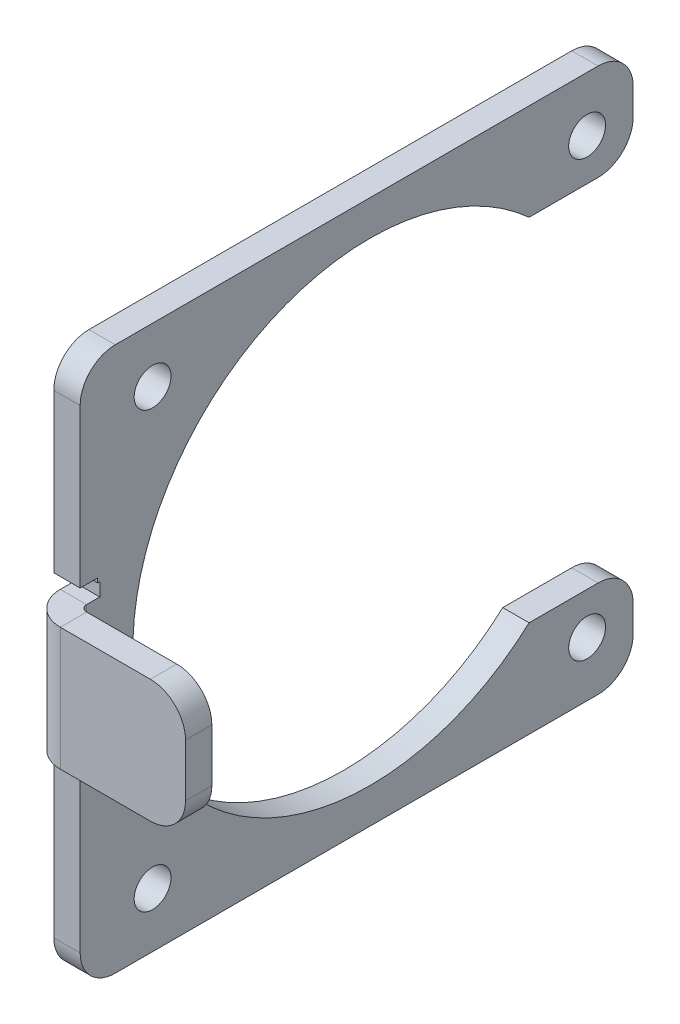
ISO-10303-21;
HEADER;
FILE_DESCRIPTION(('STEP AP214'),'2;1');
FILE_NAME('part.step','',(''),(''),'','','');
FILE_SCHEMA(('AUTOMOTIVE_DESIGN { 1 0 10303 214 1 1 1 1 }'));
ENDSEC;
DATA;
#1=APPLICATION_CONTEXT('core data for automotive mechanical design processes');
#2=APPLICATION_PROTOCOL_DEFINITION('international standard','automotive_design',2000,#1);
#3=PRODUCT_CONTEXT('',#1,'mechanical');
#4=PRODUCT('Part','Part','',(#3));
#5=PRODUCT_RELATED_PRODUCT_CATEGORY('part','',(#4));
#6=PRODUCT_DEFINITION_FORMATION('','',#4);
#7=PRODUCT_DEFINITION_CONTEXT('part definition',#1,'design');
#8=PRODUCT_DEFINITION('design','',#6,#7);
#9=PRODUCT_DEFINITION_SHAPE('','',#8);
#10=(LENGTH_UNIT() NAMED_UNIT(*) SI_UNIT(.MILLI.,.METRE.));
#11=(NAMED_UNIT(*) PLANE_ANGLE_UNIT() SI_UNIT($,.RADIAN.));
#12=(NAMED_UNIT(*) SI_UNIT($,.STERADIAN.) SOLID_ANGLE_UNIT());
#13=UNCERTAINTY_MEASURE_WITH_UNIT(LENGTH_MEASURE(1.E-05),#10,'distance_accuracy_value','');
#14=(GEOMETRIC_REPRESENTATION_CONTEXT(3) GLOBAL_UNCERTAINTY_ASSIGNED_CONTEXT((#13)) GLOBAL_UNIT_ASSIGNED_CONTEXT((#10,
#11,#12)) REPRESENTATION_CONTEXT('',''));
#15=CARTESIAN_POINT('',(0.,0.,0.));
#16=DIRECTION('',(0.,0.,1.));
#17=DIRECTION('',(1.,0.,0.));
#18=AXIS2_PLACEMENT_3D('',#15,#16,#17);
#19=CARTESIAN_POINT('',(-3.,0.,0.));
#20=DIRECTION('',(-1.,0.,0.));
#21=DIRECTION('',(0.,0.,1.));
#22=AXIS2_PLACEMENT_3D('',#19,#20,#21);
#23=PLANE('',#22);
#24=CARTESIAN_POINT('',(-3.,55.7487373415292,-8.25126265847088));
#25=DIRECTION('',(1.,0.,0.));
#26=DIRECTION('',(0.,0.,-1.));
#27=AXIS2_PLACEMENT_3D('',#24,#25,#26);
#28=CIRCLE('',#27,2.1);
#29=CARTESIAN_POINT('',(-3.,55.7487373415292,-10.3512626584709));
#30=VERTEX_POINT('',#29);
#31=EDGE_CURVE('E605',#30,#30,#28,.T.);
#32=ORIENTED_EDGE('',*,*,#31,.T.);
#33=EDGE_LOOP('',(#32));
#34=FACE_BOUND('',#33,.T.);
#35=DIRECTION('',(0.,0.,1.));
#36=VECTOR('',#35,1.);
#37=CARTESIAN_POINT('',(-3.,11.,0.));
#38=LINE('',#37,#36);
#39=CARTESIAN_POINT('',(-3.,11.,-51.1383571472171));
#40=VERTEX_POINT('',#39);
#41=CARTESIAN_POINT('',(-3.,11.,-59.));
#42=VERTEX_POINT('',#41);
#43=EDGE_CURVE('E260',#40,#42,#38,.F.);
#44=ORIENTED_EDGE('',*,*,#43,.T.);
#45=CARTESIAN_POINT('',(-3.,7.,-59.));
#46=DIRECTION('',(-1.,0.,0.));
#47=DIRECTION('',(0.,0.,1.));
#48=AXIS2_PLACEMENT_3D('',#45,#46,#47);
#49=CIRCLE('',#48,4.);
#50=CARTESIAN_POINT('',(-3.,7.,-63.));
#51=VERTEX_POINT('',#50);
#52=EDGE_CURVE('E445',#42,#51,#49,.T.);
#53=ORIENTED_EDGE('',*,*,#52,.T.);
#54=DIRECTION('',(0.,1.,0.));
#55=VECTOR('',#54,1.);
#56=CARTESIAN_POINT('',(-3.,0.,-63.));
#57=LINE('',#56,#55);
#58=CARTESIAN_POINT('',(-3.,4.,-63.));
#59=VERTEX_POINT('',#58);
#60=EDGE_CURVE('E412',#59,#51,#57,.T.);
#61=ORIENTED_EDGE('',*,*,#60,.F.);
#62=CARTESIAN_POINT('',(-3.,4.,-59.));
#63=DIRECTION('',(-1.,0.,0.));
#64=DIRECTION('',(0.,0.,1.));
#65=AXIS2_PLACEMENT_3D('',#62,#63,#64);
#66=CIRCLE('',#65,4.);
#67=CARTESIAN_POINT('',(-3.,0.,-59.));
#68=VERTEX_POINT('',#67);
#69=EDGE_CURVE('E440',#59,#68,#66,.T.);
#70=ORIENTED_EDGE('',*,*,#69,.T.);
#71=DIRECTION('',(0.,0.,-1.));
#72=VECTOR('',#71,1.);
#73=CARTESIAN_POINT('',(-3.,0.,0.));
#74=LINE('',#73,#72);
#75=CARTESIAN_POINT('',(-3.,0.,-4.));
#76=VERTEX_POINT('',#75);
#77=EDGE_CURVE('E405',#76,#68,#74,.T.);
#78=ORIENTED_EDGE('',*,*,#77,.F.);
#79=CARTESIAN_POINT('',(-3.,4.,-4.));
#80=DIRECTION('',(-1.,0.,0.));
#81=DIRECTION('',(0.,0.,1.));
#82=AXIS2_PLACEMENT_3D('',#79,#80,#81);
#83=CIRCLE('',#82,4.);
#84=CARTESIAN_POINT('',(-3.,4.,0.));
#85=VERTEX_POINT('',#84);
#86=EDGE_CURVE('E442',#76,#85,#83,.T.);
#87=ORIENTED_EDGE('',*,*,#86,.T.);
#88=DIRECTION('',(0.,-1.,0.));
#89=VECTOR('',#88,1.);
#90=CARTESIAN_POINT('',(-3.,0.,0.));
#91=LINE('',#90,#89);
#92=CARTESIAN_POINT('',(-3.,22.,0.));
#93=VERTEX_POINT('',#92);
#94=EDGE_CURVE('E406',#93,#85,#91,.T.);
#95=ORIENTED_EDGE('',*,*,#94,.F.);
#96=DIRECTION('',(0.,0.,-1.));
#97=VECTOR('',#96,1.);
#98=CARTESIAN_POINT('',(-3.,22.,0.));
#99=LINE('',#98,#97);
#100=CARTESIAN_POINT('',(-3.,22.,-2.));
#101=VERTEX_POINT('',#100);
#102=EDGE_CURVE('E361',#93,#101,#99,.T.);
#103=ORIENTED_EDGE('',*,*,#102,.T.);
#104=DIRECTION('',(0.,1.,0.));
#105=VECTOR('',#104,1.);
#106=CARTESIAN_POINT('',(-3.,22.,-2.));
#107=LINE('',#106,#105);
#108=CARTESIAN_POINT('',(-3.,22.5,-2.));
#109=VERTEX_POINT('',#108);
#110=EDGE_CURVE('E364',#101,#109,#107,.T.);
#111=ORIENTED_EDGE('',*,*,#110,.T.);
#112=DIRECTION('',(0.,0.,-1.));
#113=VECTOR('',#112,1.);
#114=CARTESIAN_POINT('',(-3.,22.5,0.));
#115=LINE('',#114,#113);
#116=CARTESIAN_POINT('',(-3.,22.5,-2.23659999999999));
#117=VERTEX_POINT('',#116);
#118=EDGE_CURVE('E330',#109,#117,#115,.T.);
#119=ORIENTED_EDGE('',*,*,#118,.T.);
#120=DIRECTION('',(0.,1.,0.));
#121=VECTOR('',#120,1.);
#122=CARTESIAN_POINT('',(-3.,0.,-2.2366));
#123=LINE('',#122,#121);
#124=CARTESIAN_POINT('',(-3.,24.,-2.23659999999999));
#125=VERTEX_POINT('',#124);
#126=EDGE_CURVE('E357',#117,#125,#123,.T.);
#127=ORIENTED_EDGE('',*,*,#126,.T.);
#128=DIRECTION('',(0.,0.,1.));
#129=VECTOR('',#128,1.);
#130=CARTESIAN_POINT('',(-3.,24.,0.));
#131=LINE('',#130,#129);
#132=CARTESIAN_POINT('',(-3.,24.,-0.736599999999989));
#133=VERTEX_POINT('',#132);
#134=EDGE_CURVE('E368',#125,#133,#131,.T.);
#135=ORIENTED_EDGE('',*,*,#134,.T.);
#136=DIRECTION('',(0.,-1.,0.));
#137=VECTOR('',#136,1.);
#138=CARTESIAN_POINT('',(-3.,24.,-0.736599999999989));
#139=LINE('',#138,#137);
#140=CARTESIAN_POINT('',(-3.,38.,-0.73659999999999));
#141=VERTEX_POINT('',#140);
#142=EDGE_CURVE('E305',#133,#141,#139,.F.);
#143=ORIENTED_EDGE('',*,*,#142,.T.);
#144=DIRECTION('',(0.,0.,-1.));
#145=VECTOR('',#144,1.);
#146=CARTESIAN_POINT('',(-3.,38.,0.));
#147=LINE('',#146,#145);
#148=CARTESIAN_POINT('',(-3.,38.,-2.23659999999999));
#149=VERTEX_POINT('',#148);
#150=EDGE_CURVE('E383',#141,#149,#147,.T.);
#151=ORIENTED_EDGE('',*,*,#150,.T.);
#152=DIRECTION('',(0.,1.,0.));
#153=VECTOR('',#152,1.);
#154=CARTESIAN_POINT('',(-3.,0.,-2.2366));
#155=LINE('',#154,#153);
#156=CARTESIAN_POINT('',(-3.,39.5,-2.23659999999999));
#157=VERTEX_POINT('',#156);
#158=EDGE_CURVE('E355',#149,#157,#155,.T.);
#159=ORIENTED_EDGE('',*,*,#158,.T.);
#160=DIRECTION('',(0.,0.,1.));
#161=VECTOR('',#160,1.);
#162=CARTESIAN_POINT('',(-3.,39.5,0.));
#163=LINE('',#162,#161);
#164=CARTESIAN_POINT('',(-3.,39.5,-2.));
#165=VERTEX_POINT('',#164);
#166=EDGE_CURVE('E353',#157,#165,#163,.T.);
#167=ORIENTED_EDGE('',*,*,#166,.T.);
#168=DIRECTION('',(0.,1.,0.));
#169=VECTOR('',#168,1.);
#170=CARTESIAN_POINT('',(-3.,40.,-2.));
#171=LINE('',#170,#169);
#172=CARTESIAN_POINT('',(-3.,40.,-2.));
#173=VERTEX_POINT('',#172);
#174=EDGE_CURVE('E385',#165,#173,#171,.T.);
#175=ORIENTED_EDGE('',*,*,#174,.T.);
#176=DIRECTION('',(0.,0.,1.));
#177=VECTOR('',#176,1.);
#178=CARTESIAN_POINT('',(-3.,40.,0.));
#179=LINE('',#178,#177);
#180=CARTESIAN_POINT('',(-3.,40.,0.));
#181=VERTEX_POINT('',#180);
#182=EDGE_CURVE('E388',#173,#181,#179,.T.);
#183=ORIENTED_EDGE('',*,*,#182,.T.);
#184=CARTESIAN_POINT('',(-3.,58.,0.));
#185=VERTEX_POINT('',#184);
#186=EDGE_CURVE('E403',#185,#181,#91,.T.);
#187=ORIENTED_EDGE('',*,*,#186,.F.);
#188=CARTESIAN_POINT('',(-3.,58.,-4.));
#189=DIRECTION('',(-1.,0.,0.));
#190=DIRECTION('',(0.,0.,1.));
#191=AXIS2_PLACEMENT_3D('',#188,#189,#190);
#192=CIRCLE('',#191,4.);
#193=CARTESIAN_POINT('',(-3.,62.,-4.));
#194=VERTEX_POINT('',#193);
#195=EDGE_CURVE('E436',#185,#194,#192,.T.);
#196=ORIENTED_EDGE('',*,*,#195,.T.);
#197=DIRECTION('',(0.,0.,1.));
#198=VECTOR('',#197,1.);
#199=CARTESIAN_POINT('',(-3.,62.,0.));
#200=LINE('',#199,#198);
#201=CARTESIAN_POINT('',(-3.,62.,-59.));
#202=VERTEX_POINT('',#201);
#203=EDGE_CURVE('E413',#202,#194,#200,.T.);
#204=ORIENTED_EDGE('',*,*,#203,.F.);
#205=CARTESIAN_POINT('',(-3.,58.,-59.));
#206=DIRECTION('',(-1.,0.,0.));
#207=DIRECTION('',(0.,0.,1.));
#208=AXIS2_PLACEMENT_3D('',#205,#206,#207);
#209=CIRCLE('',#208,4.);
#210=CARTESIAN_POINT('',(-3.,58.,-63.));
#211=VERTEX_POINT('',#210);
#212=EDGE_CURVE('E438',#202,#211,#209,.T.);
#213=ORIENTED_EDGE('',*,*,#212,.T.);
#214=CARTESIAN_POINT('',(-3.,55.,-63.));
#215=VERTEX_POINT('',#214);
#216=EDGE_CURVE('E409',#215,#211,#57,.T.);
#217=ORIENTED_EDGE('',*,*,#216,.F.);
#218=CARTESIAN_POINT('',(-3.,55.,-59.));
#219=DIRECTION('',(-1.,0.,0.));
#220=DIRECTION('',(0.,0.,1.));
#221=AXIS2_PLACEMENT_3D('',#218,#219,#220);
#222=CIRCLE('',#221,4.);
#223=CARTESIAN_POINT('',(-3.,51.,-59.));
#224=VERTEX_POINT('',#223);
#225=EDGE_CURVE('E257',#215,#224,#222,.T.);
#226=ORIENTED_EDGE('',*,*,#225,.T.);
#227=DIRECTION('',(0.,0.,1.));
#228=VECTOR('',#227,1.);
#229=CARTESIAN_POINT('',(-3.,51.,0.));
#230=LINE('',#229,#228);
#231=CARTESIAN_POINT('',(-3.,51.,-51.1383571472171));
#232=VERTEX_POINT('',#231);
#233=EDGE_CURVE('E250',#224,#232,#230,.T.);
#234=ORIENTED_EDGE('',*,*,#233,.T.);
#235=CARTESIAN_POINT('',(-3.,31.,-33.));
#236=DIRECTION('',(1.,0.,0.));
#237=DIRECTION('',(0.,0.,-1.));
#238=AXIS2_PLACEMENT_3D('',#235,#236,#237);
#239=CIRCLE('',#238,27.);
#240=EDGE_CURVE('E255',#232,#40,#239,.T.);
#241=ORIENTED_EDGE('',*,*,#240,.T.);
#242=EDGE_LOOP('',(#44,#53,#61,#70,#78,#87,#95,#103,#111,#119,#127,#135,#143,#151,#159,#167,
#175,#183,#187,#196,#204,#213,#217,#226,#234,#241));
#243=FACE_BOUND('',#242,.T.);
#244=CARTESIAN_POINT('',(-3.,6.2512626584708,-8.25126265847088));
#245=DIRECTION('',(1.,0.,0.));
#246=DIRECTION('',(0.,0.,-1.));
#247=AXIS2_PLACEMENT_3D('',#244,#245,#246);
#248=CIRCLE('',#247,2.1);
#249=CARTESIAN_POINT('',(-3.,6.2512626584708,-10.3512626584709));
#250=VERTEX_POINT('',#249);
#251=EDGE_CURVE('E582',#250,#250,#248,.T.);
#252=ORIENTED_EDGE('',*,*,#251,.T.);
#253=EDGE_LOOP('',(#252));
#254=FACE_BOUND('',#253,.T.);
#255=CARTESIAN_POINT('',(-3.,6.2512626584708,-57.7487373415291));
#256=DIRECTION('',(1.,0.,0.));
#257=DIRECTION('',(0.,0.,-1.));
#258=AXIS2_PLACEMENT_3D('',#255,#256,#257);
#259=CIRCLE('',#258,2.1);
#260=CARTESIAN_POINT('',(-3.,6.2512626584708,-59.8487373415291));
#261=VERTEX_POINT('',#260);
#262=EDGE_CURVE('E593',#261,#261,#259,.T.);
#263=ORIENTED_EDGE('',*,*,#262,.T.);
#264=EDGE_LOOP('',(#263));
#265=FACE_BOUND('',#264,.T.);
#266=CARTESIAN_POINT('',(-3.,55.7487373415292,-57.7487373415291));
#267=DIRECTION('',(1.,0.,0.));
#268=DIRECTION('',(0.,0.,-1.));
#269=AXIS2_PLACEMENT_3D('',#266,#267,#268);
#270=CIRCLE('',#269,2.1);
#271=CARTESIAN_POINT('',(-3.,55.7487373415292,-59.8487373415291));
#272=VERTEX_POINT('',#271);
#273=EDGE_CURVE('E599',#272,#272,#270,.T.);
#274=ORIENTED_EDGE('',*,*,#273,.T.);
#275=EDGE_LOOP('',(#274));
#276=FACE_BOUND('',#275,.T.);
#277=ADVANCED_FACE('F38',(#34,#243,#254,#265,#276),#23,.T.);
#278=CARTESIAN_POINT('',(0.,0.,0.));
#279=DIRECTION('',(-1.,0.,0.));
#280=DIRECTION('',(0.,0.,1.));
#281=AXIS2_PLACEMENT_3D('',#278,#279,#280);
#282=PLANE('',#281);
#283=CARTESIAN_POINT('',(0.,55.7487373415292,-8.25126265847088));
#284=DIRECTION('',(1.,0.,0.));
#285=DIRECTION('',(0.,0.,-1.));
#286=AXIS2_PLACEMENT_3D('',#283,#284,#285);
#287=CIRCLE('',#286,2.1);
#288=CARTESIAN_POINT('',(0.,55.7487373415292,-10.3512626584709));
#289=VERTEX_POINT('',#288);
#290=EDGE_CURVE('E608',#289,#289,#287,.T.);
#291=ORIENTED_EDGE('',*,*,#290,.F.);
#292=EDGE_LOOP('',(#291));
#293=FACE_BOUND('',#292,.T.);
#294=CARTESIAN_POINT('',(0.,55.7487373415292,-57.7487373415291));
#295=DIRECTION('',(1.,0.,0.));
#296=DIRECTION('',(0.,0.,-1.));
#297=AXIS2_PLACEMENT_3D('',#294,#295,#296);
#298=CIRCLE('',#297,2.1);
#299=CARTESIAN_POINT('',(0.,55.7487373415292,-59.8487373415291));
#300=VERTEX_POINT('',#299);
#301=EDGE_CURVE('E602',#300,#300,#298,.T.);
#302=ORIENTED_EDGE('',*,*,#301,.F.);
#303=EDGE_LOOP('',(#302));
#304=FACE_BOUND('',#303,.T.);
#305=CARTESIAN_POINT('',(0.,6.2512626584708,-57.7487373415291));
#306=DIRECTION('',(1.,0.,0.));
#307=DIRECTION('',(0.,0.,-1.));
#308=AXIS2_PLACEMENT_3D('',#305,#306,#307);
#309=CIRCLE('',#308,2.1);
#310=CARTESIAN_POINT('',(0.,6.2512626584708,-59.8487373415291));
#311=VERTEX_POINT('',#310);
#312=EDGE_CURVE('E596',#311,#311,#309,.T.);
#313=ORIENTED_EDGE('',*,*,#312,.F.);
#314=EDGE_LOOP('',(#313));
#315=FACE_BOUND('',#314,.T.);
#316=CARTESIAN_POINT('',(0.,6.2512626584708,-8.25126265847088));
#317=DIRECTION('',(1.,0.,0.));
#318=DIRECTION('',(0.,0.,-1.));
#319=AXIS2_PLACEMENT_3D('',#316,#317,#318);
#320=CIRCLE('',#319,2.1);
#321=CARTESIAN_POINT('',(0.,6.2512626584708,-10.3512626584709));
#322=VERTEX_POINT('',#321);
#323=EDGE_CURVE('E587',#322,#322,#320,.T.);
#324=ORIENTED_EDGE('',*,*,#323,.F.);
#325=EDGE_LOOP('',(#324));
#326=FACE_BOUND('',#325,.T.);
#327=DIRECTION('',(0.,1.,0.));
#328=VECTOR('',#327,1.);
#329=CARTESIAN_POINT('',(0.,0.,-63.));
#330=LINE('',#329,#328);
#331=CARTESIAN_POINT('',(0.,4.,-63.));
#332=VERTEX_POINT('',#331);
#333=CARTESIAN_POINT('',(0.,7.,-63.));
#334=VERTEX_POINT('',#333);
#335=EDGE_CURVE('E425',#332,#334,#330,.T.);
#336=ORIENTED_EDGE('',*,*,#335,.T.);
#337=CARTESIAN_POINT('',(0.,7.,-59.));
#338=DIRECTION('',(-1.,0.,0.));
#339=DIRECTION('',(0.,0.,1.));
#340=AXIS2_PLACEMENT_3D('',#337,#338,#339);
#341=CIRCLE('',#340,4.);
#342=CARTESIAN_POINT('',(0.,11.,-59.));
#343=VERTEX_POINT('',#342);
#344=EDGE_CURVE('E461',#334,#343,#341,.F.);
#345=ORIENTED_EDGE('',*,*,#344,.T.);
#346=DIRECTION('',(0.,0.,-1.));
#347=VECTOR('',#346,1.);
#348=CARTESIAN_POINT('',(0.,11.,-63.));
#349=LINE('',#348,#347);
#350=CARTESIAN_POINT('',(0.,11.,-51.1383571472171));
#351=VERTEX_POINT('',#350);
#352=EDGE_CURVE('E261',#351,#343,#349,.T.);
#353=ORIENTED_EDGE('',*,*,#352,.F.);
#354=CARTESIAN_POINT('',(0.,31.,-33.));
#355=DIRECTION('',(1.,0.,0.));
#356=DIRECTION('',(0.,0.,-1.));
#357=AXIS2_PLACEMENT_3D('',#354,#355,#356);
#358=CIRCLE('',#357,27.);
#359=CARTESIAN_POINT('',(0.,51.,-51.1383571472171));
#360=VERTEX_POINT('',#359);
#361=EDGE_CURVE('E276',#360,#351,#358,.T.);
#362=ORIENTED_EDGE('',*,*,#361,.F.);
#363=DIRECTION('',(0.,0.,1.));
#364=VECTOR('',#363,1.);
#365=CARTESIAN_POINT('',(0.,51.,-63.));
#366=LINE('',#365,#364);
#367=CARTESIAN_POINT('',(0.,51.,-59.));
#368=VERTEX_POINT('',#367);
#369=EDGE_CURVE('E267',#368,#360,#366,.T.);
#370=ORIENTED_EDGE('',*,*,#369,.F.);
#371=CARTESIAN_POINT('',(0.,55.,-59.));
#372=DIRECTION('',(-1.,0.,0.));
#373=DIRECTION('',(0.,0.,1.));
#374=AXIS2_PLACEMENT_3D('',#371,#372,#373);
#375=CIRCLE('',#374,4.);
#376=CARTESIAN_POINT('',(0.,55.,-63.));
#377=VERTEX_POINT('',#376);
#378=EDGE_CURVE('E459',#368,#377,#375,.F.);
#379=ORIENTED_EDGE('',*,*,#378,.T.);
#380=CARTESIAN_POINT('',(0.,58.,-63.));
#381=VERTEX_POINT('',#380);
#382=EDGE_CURVE('E422',#377,#381,#330,.T.);
#383=ORIENTED_EDGE('',*,*,#382,.T.);
#384=CARTESIAN_POINT('',(0.,58.,-59.));
#385=DIRECTION('',(-1.,0.,0.));
#386=DIRECTION('',(0.,0.,1.));
#387=AXIS2_PLACEMENT_3D('',#384,#385,#386);
#388=CIRCLE('',#387,4.);
#389=CARTESIAN_POINT('',(0.,62.,-59.));
#390=VERTEX_POINT('',#389);
#391=EDGE_CURVE('E453',#381,#390,#388,.F.);
#392=ORIENTED_EDGE('',*,*,#391,.T.);
#393=DIRECTION('',(0.,0.,1.));
#394=VECTOR('',#393,1.);
#395=CARTESIAN_POINT('',(0.,62.,0.));
#396=LINE('',#395,#394);
#397=CARTESIAN_POINT('',(0.,62.,-4.));
#398=VERTEX_POINT('',#397);
#399=EDGE_CURVE('E426',#390,#398,#396,.T.);
#400=ORIENTED_EDGE('',*,*,#399,.T.);
#401=CARTESIAN_POINT('',(0.,58.,-4.));
#402=DIRECTION('',(-1.,0.,0.));
#403=DIRECTION('',(0.,0.,1.));
#404=AXIS2_PLACEMENT_3D('',#401,#402,#403);
#405=CIRCLE('',#404,4.);
#406=CARTESIAN_POINT('',(0.,58.,0.));
#407=VERTEX_POINT('',#406);
#408=EDGE_CURVE('E451',#398,#407,#405,.F.);
#409=ORIENTED_EDGE('',*,*,#408,.T.);
#410=DIRECTION('',(0.,-1.,0.));
#411=VECTOR('',#410,1.);
#412=CARTESIAN_POINT('',(0.,0.,0.));
#413=LINE('',#412,#411);
#414=CARTESIAN_POINT('',(0.,40.,0.));
#415=VERTEX_POINT('',#414);
#416=EDGE_CURVE('E417',#407,#415,#413,.T.);
#417=ORIENTED_EDGE('',*,*,#416,.T.);
#418=DIRECTION('',(0.,0.,1.));
#419=VECTOR('',#418,1.);
#420=CARTESIAN_POINT('',(0.,40.,0.));
#421=LINE('',#420,#419);
#422=CARTESIAN_POINT('',(0.,40.,-2.));
#423=VERTEX_POINT('',#422);
#424=EDGE_CURVE('E386',#423,#415,#421,.T.);
#425=ORIENTED_EDGE('',*,*,#424,.F.);
#426=DIRECTION('',(0.,1.,0.));
#427=VECTOR('',#426,1.);
#428=CARTESIAN_POINT('',(0.,40.,-2.));
#429=LINE('',#428,#427);
#430=CARTESIAN_POINT('',(0.,39.5,-2.));
#431=VERTEX_POINT('',#430);
#432=EDGE_CURVE('E393',#431,#423,#429,.T.);
#433=ORIENTED_EDGE('',*,*,#432,.F.);
#434=DIRECTION('',(0.,0.,1.));
#435=VECTOR('',#434,1.);
#436=CARTESIAN_POINT('',(0.,39.5,-2.23659999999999));
#437=LINE('',#436,#435);
#438=CARTESIAN_POINT('',(0.,39.5,-2.23659999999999));
#439=VERTEX_POINT('',#438);
#440=EDGE_CURVE('E340',#439,#431,#437,.T.);
#441=ORIENTED_EDGE('',*,*,#440,.F.);
#442=DIRECTION('',(0.,1.,0.));
#443=VECTOR('',#442,1.);
#444=CARTESIAN_POINT('',(0.,38.,-2.23659999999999));
#445=LINE('',#444,#443);
#446=CARTESIAN_POINT('',(0.,38.,-2.23659999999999));
#447=VERTEX_POINT('',#446);
#448=EDGE_CURVE('E335',#447,#439,#445,.T.);
#449=ORIENTED_EDGE('',*,*,#448,.F.);
#450=DIRECTION('',(0.,0.,-1.));
#451=VECTOR('',#450,1.);
#452=CARTESIAN_POINT('',(0.,38.,0.));
#453=LINE('',#452,#451);
#454=CARTESIAN_POINT('',(0.,38.,-0.73659999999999));
#455=VERTEX_POINT('',#454);
#456=EDGE_CURVE('E380',#455,#447,#453,.T.);
#457=ORIENTED_EDGE('',*,*,#456,.F.);
#458=DIRECTION('',(0.,-1.,0.));
#459=VECTOR('',#458,1.);
#460=CARTESIAN_POINT('',(0.,24.,-0.736599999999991));
#461=LINE('',#460,#459);
#462=CARTESIAN_POINT('',(0.,24.,-0.736599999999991));
#463=VERTEX_POINT('',#462);
#464=EDGE_CURVE('E318',#463,#455,#461,.F.);
#465=ORIENTED_EDGE('',*,*,#464,.F.);
#466=DIRECTION('',(0.,0.,1.));
#467=VECTOR('',#466,1.);
#468=CARTESIAN_POINT('',(0.,24.,0.));
#469=LINE('',#468,#467);
#470=CARTESIAN_POINT('',(0.,24.,-2.23659999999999));
#471=VERTEX_POINT('',#470);
#472=EDGE_CURVE('E365',#471,#463,#469,.T.);
#473=ORIENTED_EDGE('',*,*,#472,.F.);
#474=DIRECTION('',(0.,1.,0.));
#475=VECTOR('',#474,1.);
#476=CARTESIAN_POINT('',(0.,22.5,-2.23659999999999));
#477=LINE('',#476,#475);
#478=CARTESIAN_POINT('',(0.,22.5,-2.23659999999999));
#479=VERTEX_POINT('',#478);
#480=EDGE_CURVE('E331',#479,#471,#477,.T.);
#481=ORIENTED_EDGE('',*,*,#480,.F.);
#482=DIRECTION('',(0.,0.,-1.));
#483=VECTOR('',#482,1.);
#484=CARTESIAN_POINT('',(0.,22.5,0.));
#485=LINE('',#484,#483);
#486=CARTESIAN_POINT('',(0.,22.5,-2.));
#487=VERTEX_POINT('',#486);
#488=EDGE_CURVE('E328',#487,#479,#485,.T.);
#489=ORIENTED_EDGE('',*,*,#488,.F.);
#490=DIRECTION('',(0.,1.,0.));
#491=VECTOR('',#490,1.);
#492=CARTESIAN_POINT('',(0.,22.,-2.));
#493=LINE('',#492,#491);
#494=CARTESIAN_POINT('',(0.,22.,-2.));
#495=VERTEX_POINT('',#494);
#496=EDGE_CURVE('E373',#495,#487,#493,.T.);
#497=ORIENTED_EDGE('',*,*,#496,.F.);
#498=DIRECTION('',(0.,0.,-1.));
#499=VECTOR('',#498,1.);
#500=CARTESIAN_POINT('',(0.,22.,0.));
#501=LINE('',#500,#499);
#502=CARTESIAN_POINT('',(0.,22.,0.));
#503=VERTEX_POINT('',#502);
#504=EDGE_CURVE('E360',#503,#495,#501,.T.);
#505=ORIENTED_EDGE('',*,*,#504,.F.);
#506=CARTESIAN_POINT('',(0.,4.,0.));
#507=VERTEX_POINT('',#506);
#508=EDGE_CURVE('E400',#503,#507,#413,.T.);
#509=ORIENTED_EDGE('',*,*,#508,.T.);
#510=CARTESIAN_POINT('',(0.,4.,-4.));
#511=DIRECTION('',(-1.,0.,0.));
#512=DIRECTION('',(0.,0.,1.));
#513=AXIS2_PLACEMENT_3D('',#510,#511,#512);
#514=CIRCLE('',#513,4.);
#515=CARTESIAN_POINT('',(0.,0.,-4.));
#516=VERTEX_POINT('',#515);
#517=EDGE_CURVE('E457',#507,#516,#514,.F.);
#518=ORIENTED_EDGE('',*,*,#517,.T.);
#519=DIRECTION('',(0.,0.,-1.));
#520=VECTOR('',#519,1.);
#521=CARTESIAN_POINT('',(0.,0.,0.));
#522=LINE('',#521,#520);
#523=CARTESIAN_POINT('',(0.,0.,-59.));
#524=VERTEX_POINT('',#523);
#525=EDGE_CURVE('E419',#516,#524,#522,.T.);
#526=ORIENTED_EDGE('',*,*,#525,.T.);
#527=CARTESIAN_POINT('',(0.,4.,-59.));
#528=DIRECTION('',(-1.,0.,0.));
#529=DIRECTION('',(0.,0.,1.));
#530=AXIS2_PLACEMENT_3D('',#527,#528,#529);
#531=CIRCLE('',#530,4.);
#532=EDGE_CURVE('E455',#524,#332,#531,.F.);
#533=ORIENTED_EDGE('',*,*,#532,.T.);
#534=EDGE_LOOP('',(#336,#345,#353,#362,#370,#379,#383,#392,#400,#409,#417,#425,#433,#441,#449,
#457,#465,#473,#481,#489,#497,#505,#509,#518,#526,#533));
#535=FACE_BOUND('',#534,.T.);
#536=ADVANCED_FACE('F537',(#293,#304,#315,#326,#535),#282,.F.);
#537=CARTESIAN_POINT('',(-3.,0.,-63.));
#538=DIRECTION('',(0.,0.,-1.));
#539=DIRECTION('',(-1.,0.,0.));
#540=AXIS2_PLACEMENT_3D('',#537,#538,#539);
#541=PLANE('',#540);
#542=ORIENTED_EDGE('',*,*,#60,.T.);
#543=DIRECTION('',(-1.,0.,0.));
#544=VECTOR('',#543,1.);
#545=CARTESIAN_POINT('',(-3.,7.,-63.));
#546=LINE('',#545,#544);
#547=EDGE_CURVE('E449',#51,#334,#546,.F.);
#548=ORIENTED_EDGE('',*,*,#547,.T.);
#549=ORIENTED_EDGE('',*,*,#335,.F.);
#550=DIRECTION('',(1.,0.,0.));
#551=VECTOR('',#550,1.);
#552=CARTESIAN_POINT('',(-3.,4.,-63.));
#553=LINE('',#552,#551);
#554=EDGE_CURVE('E447',#332,#59,#553,.F.);
#555=ORIENTED_EDGE('',*,*,#554,.T.);
#556=EDGE_LOOP('',(#542,#548,#549,#555));
#557=FACE_BOUND('',#556,.T.);
#558=ADVANCED_FACE('F616',(#557),#541,.T.);
#559=ORIENTED_EDGE('',*,*,#382,.F.);
#560=DIRECTION('',(-1.,0.,0.));
#561=VECTOR('',#560,1.);
#562=CARTESIAN_POINT('',(-3.,55.,-63.));
#563=LINE('',#562,#561);
#564=EDGE_CURVE('E466',#377,#215,#563,.T.);
#565=ORIENTED_EDGE('',*,*,#564,.T.);
#566=ORIENTED_EDGE('',*,*,#216,.T.);
#567=DIRECTION('',(1.,0.,0.));
#568=VECTOR('',#567,1.);
#569=CARTESIAN_POINT('',(-3.,58.,-63.));
#570=LINE('',#569,#568);
#571=EDGE_CURVE('E463',#211,#381,#570,.T.);
#572=ORIENTED_EDGE('',*,*,#571,.T.);
#573=EDGE_LOOP('',(#559,#565,#566,#572));
#574=FACE_BOUND('',#573,.T.);
#575=ADVANCED_FACE('F576',(#574),#541,.T.);
#576=CARTESIAN_POINT('',(-3.,31.,-33.));
#577=DIRECTION('',(1.,0.,0.));
#578=DIRECTION('',(0.,0.,-1.));
#579=AXIS2_PLACEMENT_3D('',#576,#577,#578);
#580=CYLINDRICAL_SURFACE('',#579,27.);
#581=DIRECTION('',(1.,0.,0.));
#582=VECTOR('',#581,1.);
#583=CARTESIAN_POINT('',(0.,11.,-51.1383571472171));
#584=LINE('',#583,#582);
#585=EDGE_CURVE('E271',#351,#40,#584,.F.);
#586=ORIENTED_EDGE('',*,*,#585,.T.);
#587=ORIENTED_EDGE('',*,*,#240,.F.);
#588=DIRECTION('',(1.,0.,0.));
#589=VECTOR('',#588,1.);
#590=CARTESIAN_POINT('',(0.,51.,-51.1383571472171));
#591=LINE('',#590,#589);
#592=EDGE_CURVE('E264',#360,#232,#591,.F.);
#593=ORIENTED_EDGE('',*,*,#592,.F.);
#594=ORIENTED_EDGE('',*,*,#361,.T.);
#595=EDGE_LOOP('',(#586,#587,#593,#594));
#596=FACE_BOUND('',#595,.T.);
#597=ADVANCED_FACE('F274',(#596),#580,.F.);
#598=CARTESIAN_POINT('',(-3.,40.,-2.));
#599=DIRECTION('',(0.,0.,-1.));
#600=DIRECTION('',(0.,1.,0.));
#601=AXIS2_PLACEMENT_3D('',#598,#599,#600);
#602=PLANE('',#601);
#603=DIRECTION('',(-1.,0.,0.));
#604=VECTOR('',#603,1.);
#605=CARTESIAN_POINT('',(-3.,39.5,-2.));
#606=LINE('',#605,#604);
#607=EDGE_CURVE('E430',#431,#165,#606,.T.);
#608=ORIENTED_EDGE('',*,*,#607,.F.);
#609=ORIENTED_EDGE('',*,*,#432,.T.);
#610=DIRECTION('',(1.,0.,0.));
#611=VECTOR('',#610,1.);
#612=CARTESIAN_POINT('',(-3.,40.,-2.));
#613=LINE('',#612,#611);
#614=EDGE_CURVE('E391',#173,#423,#613,.T.);
#615=ORIENTED_EDGE('',*,*,#614,.F.);
#616=ORIENTED_EDGE('',*,*,#174,.F.);
#617=EDGE_LOOP('',(#608,#609,#615,#616));
#618=FACE_BOUND('',#617,.T.);
#619=ADVANCED_FACE('F549',(#618),#602,.F.);
#620=CARTESIAN_POINT('',(-3.,38.,0.));
#621=DIRECTION('',(0.,-1.,0.));
#622=DIRECTION('',(0.,0.,-1.));
#623=AXIS2_PLACEMENT_3D('',#620,#621,#622);
#624=PLANE('',#623);
#625=DIRECTION('',(-1.,0.,0.));
#626=VECTOR('',#625,1.);
#627=CARTESIAN_POINT('',(0.,38.,-0.73659999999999));
#628=LINE('',#627,#626);
#629=EDGE_CURVE('E322',#455,#141,#628,.T.);
#630=ORIENTED_EDGE('',*,*,#629,.F.);
#631=ORIENTED_EDGE('',*,*,#456,.T.);
#632=DIRECTION('',(-1.,0.,0.));
#633=VECTOR('',#632,1.);
#634=CARTESIAN_POINT('',(0.,38.,-2.23659999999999));
#635=LINE('',#634,#633);
#636=EDGE_CURVE('E339',#447,#149,#635,.T.);
#637=ORIENTED_EDGE('',*,*,#636,.T.);
#638=ORIENTED_EDGE('',*,*,#150,.F.);
#639=EDGE_LOOP('',(#630,#631,#637,#638));
#640=FACE_BOUND('',#639,.T.);
#641=ADVANCED_FACE('F533',(#640),#624,.F.);
#642=CARTESIAN_POINT('',(-3.,24.,0.));
#643=DIRECTION('',(0.,1.,0.));
#644=DIRECTION('',(0.,0.,1.));
#645=AXIS2_PLACEMENT_3D('',#642,#643,#644);
#646=PLANE('',#645);
#647=DIRECTION('',(-1.,0.,0.));
#648=VECTOR('',#647,1.);
#649=CARTESIAN_POINT('',(0.,24.,-0.736599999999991));
#650=LINE('',#649,#648);
#651=EDGE_CURVE('E312',#463,#133,#650,.T.);
#652=ORIENTED_EDGE('',*,*,#651,.T.);
#653=ORIENTED_EDGE('',*,*,#134,.F.);
#654=DIRECTION('',(-1.,0.,0.));
#655=VECTOR('',#654,1.);
#656=CARTESIAN_POINT('',(0.,24.,-2.23659999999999));
#657=LINE('',#656,#655);
#658=EDGE_CURVE('E338',#471,#125,#657,.T.);
#659=ORIENTED_EDGE('',*,*,#658,.F.);
#660=ORIENTED_EDGE('',*,*,#472,.T.);
#661=EDGE_LOOP('',(#652,#653,#659,#660));
#662=FACE_BOUND('',#661,.T.);
#663=ADVANCED_FACE('F788',(#662),#646,.F.);
#664=CARTESIAN_POINT('',(-3.,22.,-2.));
#665=DIRECTION('',(0.,0.,-1.));
#666=DIRECTION('',(0.,1.,0.));
#667=AXIS2_PLACEMENT_3D('',#664,#665,#666);
#668=PLANE('',#667);
#669=DIRECTION('',(1.,0.,0.));
#670=VECTOR('',#669,1.);
#671=CARTESIAN_POINT('',(-3.,22.5,-2.));
#672=LINE('',#671,#670);
#673=EDGE_CURVE('E416',#109,#487,#672,.T.);
#674=ORIENTED_EDGE('',*,*,#673,.F.);
#675=ORIENTED_EDGE('',*,*,#110,.F.);
#676=DIRECTION('',(1.,0.,0.));
#677=VECTOR('',#676,1.);
#678=CARTESIAN_POINT('',(-3.,22.,-2.));
#679=LINE('',#678,#677);
#680=EDGE_CURVE('E371',#101,#495,#679,.T.);
#681=ORIENTED_EDGE('',*,*,#680,.T.);
#682=ORIENTED_EDGE('',*,*,#496,.T.);
#683=EDGE_LOOP('',(#674,#675,#681,#682));
#684=FACE_BOUND('',#683,.T.);
#685=ADVANCED_FACE('F659',(#684),#668,.F.);
#686=CARTESIAN_POINT('',(-3.,0.,0.));
#687=DIRECTION('',(0.,0.,1.));
#688=DIRECTION('',(1.,0.,0.));
#689=AXIS2_PLACEMENT_3D('',#686,#687,#688);
#690=PLANE('',#689);
#691=ORIENTED_EDGE('',*,*,#94,.T.);
#692=DIRECTION('',(1.,0.,0.));
#693=VECTOR('',#692,1.);
#694=CARTESIAN_POINT('',(-3.,4.,0.));
#695=LINE('',#694,#693);
#696=EDGE_CURVE('E471',#85,#507,#695,.T.);
#697=ORIENTED_EDGE('',*,*,#696,.T.);
#698=ORIENTED_EDGE('',*,*,#508,.F.);
#699=DIRECTION('',(1.,0.,0.));
#700=VECTOR('',#699,1.);
#701=CARTESIAN_POINT('',(-3.,22.,0.));
#702=LINE('',#701,#700);
#703=EDGE_CURVE('E378',#93,#503,#702,.T.);
#704=ORIENTED_EDGE('',*,*,#703,.F.);
#705=EDGE_LOOP('',(#691,#697,#698,#704));
#706=FACE_BOUND('',#705,.T.);
#707=ADVANCED_FACE('F656',(#706),#690,.T.);
#708=ORIENTED_EDGE('',*,*,#416,.F.);
#709=DIRECTION('',(1.,0.,0.));
#710=VECTOR('',#709,1.);
#711=CARTESIAN_POINT('',(-3.,58.,0.));
#712=LINE('',#711,#710);
#713=EDGE_CURVE('E484',#407,#185,#712,.F.);
#714=ORIENTED_EDGE('',*,*,#713,.T.);
#715=ORIENTED_EDGE('',*,*,#186,.T.);
#716=DIRECTION('',(1.,0.,0.));
#717=VECTOR('',#716,1.);
#718=CARTESIAN_POINT('',(-3.,40.,0.));
#719=LINE('',#718,#717);
#720=EDGE_CURVE('E397',#181,#415,#719,.T.);
#721=ORIENTED_EDGE('',*,*,#720,.T.);
#722=EDGE_LOOP('',(#708,#714,#715,#721));
#723=FACE_BOUND('',#722,.T.);
#724=ADVANCED_FACE('F558',(#723),#690,.T.);
#725=CARTESIAN_POINT('',(-3.,62.,0.));
#726=DIRECTION('',(0.,1.,0.));
#727=DIRECTION('',(0.,0.,1.));
#728=AXIS2_PLACEMENT_3D('',#725,#726,#727);
#729=PLANE('',#728);
#730=ORIENTED_EDGE('',*,*,#399,.F.);
#731=DIRECTION('',(1.,0.,0.));
#732=VECTOR('',#731,1.);
#733=CARTESIAN_POINT('',(-3.,62.,-59.));
#734=LINE('',#733,#732);
#735=EDGE_CURVE('E482',#390,#202,#734,.F.);
#736=ORIENTED_EDGE('',*,*,#735,.T.);
#737=ORIENTED_EDGE('',*,*,#203,.T.);
#738=DIRECTION('',(1.,0.,0.));
#739=VECTOR('',#738,1.);
#740=CARTESIAN_POINT('',(-3.,62.,-4.));
#741=LINE('',#740,#739);
#742=EDGE_CURVE('E479',#194,#398,#741,.T.);
#743=ORIENTED_EDGE('',*,*,#742,.T.);
#744=EDGE_LOOP('',(#730,#736,#737,#743));
#745=FACE_BOUND('',#744,.T.);
#746=ADVANCED_FACE('F568',(#745),#729,.T.);
#747=CARTESIAN_POINT('',(-3.,0.,0.));
#748=DIRECTION('',(0.,-1.,0.));
#749=DIRECTION('',(0.,0.,-1.));
#750=AXIS2_PLACEMENT_3D('',#747,#748,#749);
#751=PLANE('',#750);
#752=ORIENTED_EDGE('',*,*,#525,.F.);
#753=DIRECTION('',(1.,0.,0.));
#754=VECTOR('',#753,1.);
#755=CARTESIAN_POINT('',(-3.,0.,-4.));
#756=LINE('',#755,#754);
#757=EDGE_CURVE('E477',#516,#76,#756,.F.);
#758=ORIENTED_EDGE('',*,*,#757,.T.);
#759=ORIENTED_EDGE('',*,*,#77,.T.);
#760=DIRECTION('',(1.,0.,0.));
#761=VECTOR('',#760,1.);
#762=CARTESIAN_POINT('',(-3.,0.,-59.));
#763=LINE('',#762,#761);
#764=EDGE_CURVE('E474',#68,#524,#763,.T.);
#765=ORIENTED_EDGE('',*,*,#764,.T.);
#766=EDGE_LOOP('',(#752,#758,#759,#765));
#767=FACE_BOUND('',#766,.T.);
#768=ADVANCED_FACE('F649',(#767),#751,.T.);
#769=CARTESIAN_POINT('',(-3.,40.,0.));
#770=DIRECTION('',(0.,1.,0.));
#771=DIRECTION('',(0.,0.,1.));
#772=AXIS2_PLACEMENT_3D('',#769,#770,#771);
#773=PLANE('',#772);
#774=ORIENTED_EDGE('',*,*,#424,.T.);
#775=ORIENTED_EDGE('',*,*,#720,.F.);
#776=ORIENTED_EDGE('',*,*,#182,.F.);
#777=ORIENTED_EDGE('',*,*,#614,.T.);
#778=EDGE_LOOP('',(#774,#775,#776,#777));
#779=FACE_BOUND('',#778,.T.);
#780=ADVANCED_FACE('F555',(#779),#773,.F.);
#781=CARTESIAN_POINT('',(-3.,22.,0.));
#782=DIRECTION('',(0.,-1.,0.));
#783=DIRECTION('',(0.,0.,-1.));
#784=AXIS2_PLACEMENT_3D('',#781,#782,#783);
#785=PLANE('',#784);
#786=ORIENTED_EDGE('',*,*,#504,.T.);
#787=ORIENTED_EDGE('',*,*,#680,.F.);
#788=ORIENTED_EDGE('',*,*,#102,.F.);
#789=ORIENTED_EDGE('',*,*,#703,.T.);
#790=EDGE_LOOP('',(#786,#787,#788,#789));
#791=FACE_BOUND('',#790,.T.);
#792=ADVANCED_FACE('F826',(#791),#785,.F.);
#793=CARTESIAN_POINT('',(0.,22.5,0.));
#794=DIRECTION('',(0.,1.,0.));
#795=DIRECTION('',(0.,0.,1.));
#796=AXIS2_PLACEMENT_3D('',#793,#794,#795);
#797=PLANE('',#796);
#798=ORIENTED_EDGE('',*,*,#118,.F.);
#799=ORIENTED_EDGE('',*,*,#673,.T.);
#800=ORIENTED_EDGE('',*,*,#488,.T.);
#801=DIRECTION('',(-1.,0.,0.));
#802=VECTOR('',#801,1.);
#803=CARTESIAN_POINT('',(0.,22.5,-2.23659999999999));
#804=LINE('',#803,#802);
#805=EDGE_CURVE('E334',#479,#117,#804,.T.);
#806=ORIENTED_EDGE('',*,*,#805,.T.);
#807=EDGE_LOOP('',(#798,#799,#800,#806));
#808=FACE_BOUND('',#807,.T.);
#809=ADVANCED_FACE('F832',(#808),#797,.T.);
#810=CARTESIAN_POINT('',(0.,22.5,-2.23659999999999));
#811=DIRECTION('',(0.,0.,1.));
#812=DIRECTION('',(0.,-1.,0.));
#813=AXIS2_PLACEMENT_3D('',#810,#811,#812);
#814=PLANE('',#813);
#815=ORIENTED_EDGE('',*,*,#126,.F.);
#816=ORIENTED_EDGE('',*,*,#805,.F.);
#817=ORIENTED_EDGE('',*,*,#480,.T.);
#818=ORIENTED_EDGE('',*,*,#658,.T.);
#819=EDGE_LOOP('',(#815,#816,#817,#818));
#820=FACE_BOUND('',#819,.T.);
#821=ADVANCED_FACE('F839',(#820),#814,.T.);
#822=CARTESIAN_POINT('',(0.,38.,-2.23659999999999));
#823=DIRECTION('',(0.,0.,1.));
#824=DIRECTION('',(0.,-1.,0.));
#825=AXIS2_PLACEMENT_3D('',#822,#823,#824);
#826=PLANE('',#825);
#827=ORIENTED_EDGE('',*,*,#158,.F.);
#828=ORIENTED_EDGE('',*,*,#636,.F.);
#829=ORIENTED_EDGE('',*,*,#448,.T.);
#830=DIRECTION('',(-1.,0.,0.));
#831=VECTOR('',#830,1.);
#832=CARTESIAN_POINT('',(0.,39.5,-2.23659999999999));
#833=LINE('',#832,#831);
#834=EDGE_CURVE('E325',#439,#157,#833,.T.);
#835=ORIENTED_EDGE('',*,*,#834,.T.);
#836=EDGE_LOOP('',(#827,#828,#829,#835));
#837=FACE_BOUND('',#836,.T.);
#838=ADVANCED_FACE('F543',(#837),#826,.T.);
#839=CARTESIAN_POINT('',(0.,39.5,-2.23659999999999));
#840=DIRECTION('',(0.,-1.,0.));
#841=DIRECTION('',(0.,0.,-1.));
#842=AXIS2_PLACEMENT_3D('',#839,#840,#841);
#843=PLANE('',#842);
#844=ORIENTED_EDGE('',*,*,#166,.F.);
#845=ORIENTED_EDGE('',*,*,#834,.F.);
#846=ORIENTED_EDGE('',*,*,#440,.T.);
#847=ORIENTED_EDGE('',*,*,#607,.T.);
#848=EDGE_LOOP('',(#844,#845,#846,#847));
#849=FACE_BOUND('',#848,.T.);
#850=ADVANCED_FACE('F547',(#849),#843,.T.);
#851=CARTESIAN_POINT('',(0.736599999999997,38.,-0.73659999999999));
#852=DIRECTION('',(0.,1.,0.));
#853=DIRECTION('',(0.,0.,1.));
#854=AXIS2_PLACEMENT_3D('',#851,#852,#853);
#855=PLANE('',#854);
#856=DIRECTION('',(0.,0.,1.));
#857=VECTOR('',#856,1.);
#858=CARTESIAN_POINT('',(0.736599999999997,38.,0.));
#859=LINE('',#858,#857);
#860=CARTESIAN_POINT('',(0.736599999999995,38.,0.));
#861=VERTEX_POINT('',#860);
#862=CARTESIAN_POINT('',(0.736599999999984,38.,3.00000000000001));
#863=VERTEX_POINT('',#862);
#864=EDGE_CURVE('E275',#861,#863,#859,.T.);
#865=ORIENTED_EDGE('',*,*,#864,.F.);
#866=CARTESIAN_POINT('',(0.736599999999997,38.,-0.73659999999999));
#867=DIRECTION('',(0.,-1.,0.));
#868=DIRECTION('',(0.,0.,-1.));
#869=AXIS2_PLACEMENT_3D('',#866,#867,#868);
#870=CIRCLE('',#869,0.736600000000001);
#871=EDGE_CURVE('E315',#455,#861,#870,.F.);
#872=ORIENTED_EDGE('',*,*,#871,.F.);
#873=ORIENTED_EDGE('',*,*,#629,.T.);
#874=CARTESIAN_POINT('',(0.736599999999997,38.,-0.73659999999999));
#875=DIRECTION('',(0.,-1.,0.));
#876=DIRECTION('',(0.,0.,-1.));
#877=AXIS2_PLACEMENT_3D('',#874,#875,#876);
#878=CIRCLE('',#877,3.7366);
#879=EDGE_CURVE('E308',#141,#863,#878,.F.);
#880=ORIENTED_EDGE('',*,*,#879,.T.);
#881=EDGE_LOOP('',(#865,#872,#873,#880));
#882=FACE_BOUND('',#881,.T.);
#883=ADVANCED_FACE('F520',(#882),#855,.T.);
#884=CARTESIAN_POINT('',(0.736599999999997,24.,-0.736599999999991));
#885=DIRECTION('',(0.,1.,0.));
#886=DIRECTION('',(0.,0.,1.));
#887=AXIS2_PLACEMENT_3D('',#884,#885,#886);
#888=PLANE('',#887);
#889=CARTESIAN_POINT('',(0.736599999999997,24.,-0.736599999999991));
#890=DIRECTION('',(0.,-1.,0.));
#891=DIRECTION('',(0.,0.,-1.));
#892=AXIS2_PLACEMENT_3D('',#889,#890,#891);
#893=CIRCLE('',#892,0.736600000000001);
#894=CARTESIAN_POINT('',(0.736599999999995,24.,0.));
#895=VERTEX_POINT('',#894);
#896=EDGE_CURVE('E299',#895,#463,#893,.T.);
#897=ORIENTED_EDGE('',*,*,#896,.F.);
#898=DIRECTION('',(0.,0.,1.));
#899=VECTOR('',#898,1.);
#900=CARTESIAN_POINT('',(0.736599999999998,24.,0.));
#901=LINE('',#900,#899);
#902=CARTESIAN_POINT('',(0.736599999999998,24.,3.00000000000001));
#903=VERTEX_POINT('',#902);
#904=EDGE_CURVE('E285',#895,#903,#901,.T.);
#905=ORIENTED_EDGE('',*,*,#904,.T.);
#906=CARTESIAN_POINT('',(0.736599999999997,24.,-0.736599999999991));
#907=DIRECTION('',(0.,-1.,0.));
#908=DIRECTION('',(0.,0.,-1.));
#909=AXIS2_PLACEMENT_3D('',#906,#907,#908);
#910=CIRCLE('',#909,3.7366);
#911=EDGE_CURVE('E309',#903,#133,#910,.T.);
#912=ORIENTED_EDGE('',*,*,#911,.T.);
#913=ORIENTED_EDGE('',*,*,#651,.F.);
#914=EDGE_LOOP('',(#897,#905,#912,#913));
#915=FACE_BOUND('',#914,.T.);
#916=ADVANCED_FACE('F515',(#915),#888,.F.);
#917=CARTESIAN_POINT('',(0.736599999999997,24.,-0.736599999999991));
#918=DIRECTION('',(0.,-1.,0.));
#919=DIRECTION('',(0.,0.,1.));
#920=AXIS2_PLACEMENT_3D('',#917,#918,#919);
#921=CYLINDRICAL_SURFACE('',#920,3.7366);
#922=ORIENTED_EDGE('',*,*,#142,.F.);
#923=ORIENTED_EDGE('',*,*,#911,.F.);
#924=DIRECTION('',(0.,1.,0.));
#925=VECTOR('',#924,1.);
#926=CARTESIAN_POINT('',(0.736599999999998,0.,3.));
#927=LINE('',#926,#925);
#928=EDGE_CURVE('E287',#903,#863,#927,.T.);
#929=ORIENTED_EDGE('',*,*,#928,.T.);
#930=ORIENTED_EDGE('',*,*,#879,.F.);
#931=EDGE_LOOP('',(#922,#923,#929,#930));
#932=FACE_BOUND('',#931,.T.);
#933=ADVANCED_FACE('F517',(#932),#921,.T.);
#934=CARTESIAN_POINT('',(0.736599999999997,24.,-0.736599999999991));
#935=DIRECTION('',(0.,-1.,0.));
#936=DIRECTION('',(0.,0.,1.));
#937=AXIS2_PLACEMENT_3D('',#934,#935,#936);
#938=CYLINDRICAL_SURFACE('',#937,0.736600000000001);
#939=ORIENTED_EDGE('',*,*,#464,.T.);
#940=ORIENTED_EDGE('',*,*,#871,.T.);
#941=DIRECTION('',(0.,-1.,0.));
#942=VECTOR('',#941,1.);
#943=CARTESIAN_POINT('',(0.736599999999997,38.,0.));
#944=LINE('',#943,#942);
#945=EDGE_CURVE('E279',#861,#895,#944,.T.);
#946=ORIENTED_EDGE('',*,*,#945,.T.);
#947=ORIENTED_EDGE('',*,*,#896,.T.);
#948=EDGE_LOOP('',(#939,#940,#946,#947));
#949=FACE_BOUND('',#948,.T.);
#950=ADVANCED_FACE('F528',(#949),#938,.F.);
#951=CARTESIAN_POINT('',(0.,38.,3.00000000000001));
#952=DIRECTION('',(0.,-1.,0.));
#953=DIRECTION('',(0.,0.,-1.));
#954=AXIS2_PLACEMENT_3D('',#951,#952,#953);
#955=PLANE('',#954);
#956=DIRECTION('',(-1.,0.,0.));
#957=VECTOR('',#956,1.);
#958=CARTESIAN_POINT('',(0.,38.,3.00000000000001));
#959=LINE('',#958,#957);
#960=CARTESIAN_POINT('',(11.,38.,3.00000000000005));
#961=VERTEX_POINT('',#960);
#962=EDGE_CURVE('E292',#961,#863,#959,.T.);
#963=ORIENTED_EDGE('',*,*,#962,.F.);
#964=DIRECTION('',(0.,0.,-1.));
#965=VECTOR('',#964,1.);
#966=CARTESIAN_POINT('',(11.,38.,3.00000000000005));
#967=LINE('',#966,#965);
#968=CARTESIAN_POINT('',(11.,38.,0.));
#969=VERTEX_POINT('',#968);
#970=EDGE_CURVE('E11',#961,#969,#967,.T.);
#971=ORIENTED_EDGE('',*,*,#970,.T.);
#972=DIRECTION('',(-1.,0.,0.));
#973=VECTOR('',#972,1.);
#974=CARTESIAN_POINT('',(0.,38.,0.));
#975=LINE('',#974,#973);
#976=EDGE_CURVE('E291',#969,#861,#975,.T.);
#977=ORIENTED_EDGE('',*,*,#976,.T.);
#978=ORIENTED_EDGE('',*,*,#864,.T.);
#979=EDGE_LOOP('',(#963,#971,#977,#978));
#980=FACE_BOUND('',#979,.T.);
#981=ADVANCED_FACE('F524',(#980),#955,.F.);
#982=CARTESIAN_POINT('',(15.,24.,3.00000000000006));
#983=DIRECTION('',(0.,1.,0.));
#984=DIRECTION('',(-1.,0.,0.));
#985=AXIS2_PLACEMENT_3D('',#982,#983,#984);
#986=PLANE('',#985);
#987=DIRECTION('',(1.,0.,0.));
#988=VECTOR('',#987,1.);
#989=CARTESIAN_POINT('',(15.,24.,0.));
#990=LINE('',#989,#988);
#991=CARTESIAN_POINT('',(11.,24.,0.));
#992=VERTEX_POINT('',#991);
#993=EDGE_CURVE('E301',#895,#992,#990,.T.);
#994=ORIENTED_EDGE('',*,*,#993,.T.);
#995=DIRECTION('',(0.,0.,-1.));
#996=VECTOR('',#995,1.);
#997=CARTESIAN_POINT('',(11.,24.,3.00000000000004));
#998=LINE('',#997,#996);
#999=CARTESIAN_POINT('',(11.,24.,3.00000000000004));
#1000=VERTEX_POINT('',#999);
#1001=EDGE_CURVE('E61',#992,#1000,#998,.F.);
#1002=ORIENTED_EDGE('',*,*,#1001,.T.);
#1003=DIRECTION('',(1.,0.,0.));
#1004=VECTOR('',#1003,1.);
#1005=CARTESIAN_POINT('',(15.,24.,3.00000000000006));
#1006=LINE('',#1005,#1004);
#1007=EDGE_CURVE('E294',#903,#1000,#1006,.T.);
#1008=ORIENTED_EDGE('',*,*,#1007,.F.);
#1009=ORIENTED_EDGE('',*,*,#904,.F.);
#1010=EDGE_LOOP('',(#994,#1002,#1008,#1009));
#1011=FACE_BOUND('',#1010,.T.);
#1012=ADVANCED_FACE('F512',(#1011),#986,.F.);
#1013=CARTESIAN_POINT('',(0.,0.,3.));
#1014=DIRECTION('',(0.,0.,-1.));
#1015=DIRECTION('',(-1.,0.,0.));
#1016=AXIS2_PLACEMENT_3D('',#1013,#1014,#1015);
#1017=PLANE('',#1016);
#1018=ORIENTED_EDGE('',*,*,#1007,.T.);
#1019=CARTESIAN_POINT('',(11.,28.,3.00000000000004));
#1020=DIRECTION('',(0.,0.,-1.));
#1021=DIRECTION('',(-1.,0.,0.));
#1022=AXIS2_PLACEMENT_3D('',#1019,#1020,#1021);
#1023=CIRCLE('',#1022,4.);
#1024=CARTESIAN_POINT('',(15.,28.,3.00000000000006));
#1025=VERTEX_POINT('',#1024);
#1026=EDGE_CURVE('E46',#1000,#1025,#1023,.F.);
#1027=ORIENTED_EDGE('',*,*,#1026,.T.);
#1028=DIRECTION('',(0.,1.,0.));
#1029=VECTOR('',#1028,1.);
#1030=CARTESIAN_POINT('',(15.,38.,3.00000000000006));
#1031=LINE('',#1030,#1029);
#1032=CARTESIAN_POINT('',(15.,34.,3.00000000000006));
#1033=VERTEX_POINT('',#1032);
#1034=EDGE_CURVE('E297',#1025,#1033,#1031,.T.);
#1035=ORIENTED_EDGE('',*,*,#1034,.T.);
#1036=CARTESIAN_POINT('',(11.,34.,3.00000000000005));
#1037=DIRECTION('',(0.,0.,-1.));
#1038=DIRECTION('',(-1.,0.,0.));
#1039=AXIS2_PLACEMENT_3D('',#1036,#1037,#1038);
#1040=CIRCLE('',#1039,4.);
#1041=EDGE_CURVE('E53',#1033,#961,#1040,.F.);
#1042=ORIENTED_EDGE('',*,*,#1041,.T.);
#1043=ORIENTED_EDGE('',*,*,#962,.T.);
#1044=ORIENTED_EDGE('',*,*,#928,.F.);
#1045=EDGE_LOOP('',(#1018,#1027,#1035,#1042,#1043,#1044));
#1046=FACE_BOUND('',#1045,.T.);
#1047=ADVANCED_FACE('F498',(#1046),#1017,.F.);
#1048=CARTESIAN_POINT('',(0.,0.,0.));
#1049=DIRECTION('',(0.,0.,-1.));
#1050=DIRECTION('',(-1.,0.,0.));
#1051=AXIS2_PLACEMENT_3D('',#1048,#1049,#1050);
#1052=PLANE('',#1051);
#1053=DIRECTION('',(0.,1.,0.));
#1054=VECTOR('',#1053,1.);
#1055=CARTESIAN_POINT('',(15.,38.,0.));
#1056=LINE('',#1055,#1054);
#1057=CARTESIAN_POINT('',(15.,28.,0.));
#1058=VERTEX_POINT('',#1057);
#1059=CARTESIAN_POINT('',(15.,34.,0.));
#1060=VERTEX_POINT('',#1059);
#1061=EDGE_CURVE('E295',#1058,#1060,#1056,.T.);
#1062=ORIENTED_EDGE('',*,*,#1061,.F.);
#1063=CARTESIAN_POINT('',(11.,28.,0.));
#1064=DIRECTION('',(0.,0.,-1.));
#1065=DIRECTION('',(-1.,0.,0.));
#1066=AXIS2_PLACEMENT_3D('',#1063,#1064,#1065);
#1067=CIRCLE('',#1066,4.);
#1068=EDGE_CURVE('E493',#1058,#992,#1067,.T.);
#1069=ORIENTED_EDGE('',*,*,#1068,.T.);
#1070=ORIENTED_EDGE('',*,*,#993,.F.);
#1071=ORIENTED_EDGE('',*,*,#945,.F.);
#1072=ORIENTED_EDGE('',*,*,#976,.F.);
#1073=CARTESIAN_POINT('',(11.,34.,0.));
#1074=DIRECTION('',(0.,0.,-1.));
#1075=DIRECTION('',(-1.,0.,0.));
#1076=AXIS2_PLACEMENT_3D('',#1073,#1074,#1075);
#1077=CIRCLE('',#1076,4.);
#1078=EDGE_CURVE('E491',#969,#1060,#1077,.T.);
#1079=ORIENTED_EDGE('',*,*,#1078,.T.);
#1080=EDGE_LOOP('',(#1062,#1069,#1070,#1071,#1072,#1079));
#1081=FACE_BOUND('',#1080,.T.);
#1082=ADVANCED_FACE('F509',(#1081),#1052,.T.);
#1083=CARTESIAN_POINT('',(15.,38.,3.00000000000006));
#1084=DIRECTION('',(-1.,0.,0.));
#1085=DIRECTION('',(0.,0.,1.));
#1086=AXIS2_PLACEMENT_3D('',#1083,#1084,#1085);
#1087=PLANE('',#1086);
#1088=ORIENTED_EDGE('',*,*,#1034,.F.);
#1089=DIRECTION('',(0.,0.,-1.));
#1090=VECTOR('',#1089,1.);
#1091=CARTESIAN_POINT('',(15.,28.,3.00000000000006));
#1092=LINE('',#1091,#1090);
#1093=EDGE_CURVE('E488',#1025,#1058,#1092,.T.);
#1094=ORIENTED_EDGE('',*,*,#1093,.T.);
#1095=ORIENTED_EDGE('',*,*,#1061,.T.);
#1096=DIRECTION('',(0.,0.,-1.));
#1097=VECTOR('',#1096,1.);
#1098=CARTESIAN_POINT('',(15.,34.,3.00000000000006));
#1099=LINE('',#1098,#1097);
#1100=EDGE_CURVE('E486',#1060,#1033,#1099,.F.);
#1101=ORIENTED_EDGE('',*,*,#1100,.T.);
#1102=EDGE_LOOP('',(#1088,#1094,#1095,#1101));
#1103=FACE_BOUND('',#1102,.T.);
#1104=ADVANCED_FACE('F503',(#1103),#1087,.F.);
#1105=CARTESIAN_POINT('',(0.,51.,-63.));
#1106=DIRECTION('',(0.,-1.,0.));
#1107=DIRECTION('',(0.,0.,1.));
#1108=AXIS2_PLACEMENT_3D('',#1105,#1106,#1107);
#1109=PLANE('',#1108);
#1110=ORIENTED_EDGE('',*,*,#233,.F.);
#1111=DIRECTION('',(-1.,0.,0.));
#1112=VECTOR('',#1111,1.);
#1113=CARTESIAN_POINT('',(0.,51.,-59.));
#1114=LINE('',#1113,#1112);
#1115=EDGE_CURVE('E469',#224,#368,#1114,.F.);
#1116=ORIENTED_EDGE('',*,*,#1115,.T.);
#1117=ORIENTED_EDGE('',*,*,#369,.T.);
#1118=ORIENTED_EDGE('',*,*,#592,.T.);
#1119=EDGE_LOOP('',(#1110,#1116,#1117,#1118));
#1120=FACE_BOUND('',#1119,.T.);
#1121=ADVANCED_FACE('F265',(#1120),#1109,.T.);
#1122=CARTESIAN_POINT('',(0.,11.,-63.));
#1123=DIRECTION('',(0.,1.,0.));
#1124=DIRECTION('',(0.,0.,-1.));
#1125=AXIS2_PLACEMENT_3D('',#1122,#1123,#1124);
#1126=PLANE('',#1125);
#1127=ORIENTED_EDGE('',*,*,#352,.T.);
#1128=DIRECTION('',(-1.,0.,0.));
#1129=VECTOR('',#1128,1.);
#1130=CARTESIAN_POINT('',(0.,11.,-59.));
#1131=LINE('',#1130,#1129);
#1132=EDGE_CURVE('E433',#343,#42,#1131,.T.);
#1133=ORIENTED_EDGE('',*,*,#1132,.T.);
#1134=ORIENTED_EDGE('',*,*,#43,.F.);
#1135=ORIENTED_EDGE('',*,*,#585,.F.);
#1136=EDGE_LOOP('',(#1127,#1133,#1134,#1135));
#1137=FACE_BOUND('',#1136,.T.);
#1138=ADVANCED_FACE('F664',(#1137),#1126,.T.);
#1139=CARTESIAN_POINT('',(0.,7.,-59.));
#1140=DIRECTION('',(-1.,0.,0.));
#1141=DIRECTION('',(0.,0.,1.));
#1142=AXIS2_PLACEMENT_3D('',#1139,#1140,#1141);
#1143=CYLINDRICAL_SURFACE('',#1142,4.);
#1144=ORIENTED_EDGE('',*,*,#344,.F.);
#1145=ORIENTED_EDGE('',*,*,#547,.F.);
#1146=ORIENTED_EDGE('',*,*,#52,.F.);
#1147=ORIENTED_EDGE('',*,*,#1132,.F.);
#1148=EDGE_LOOP('',(#1144,#1145,#1146,#1147));
#1149=FACE_BOUND('',#1148,.T.);
#1150=ADVANCED_FACE('F661',(#1149),#1143,.T.);
#1151=CARTESIAN_POINT('',(-3.,55.,-59.));
#1152=DIRECTION('',(-1.,0.,0.));
#1153=DIRECTION('',(0.,0.,1.));
#1154=AXIS2_PLACEMENT_3D('',#1151,#1152,#1153);
#1155=CYLINDRICAL_SURFACE('',#1154,4.);
#1156=ORIENTED_EDGE('',*,*,#378,.F.);
#1157=ORIENTED_EDGE('',*,*,#1115,.F.);
#1158=ORIENTED_EDGE('',*,*,#225,.F.);
#1159=ORIENTED_EDGE('',*,*,#564,.F.);
#1160=EDGE_LOOP('',(#1156,#1157,#1158,#1159));
#1161=FACE_BOUND('',#1160,.T.);
#1162=ADVANCED_FACE('F580',(#1161),#1155,.T.);
#1163=CARTESIAN_POINT('',(-3.,4.,-4.));
#1164=DIRECTION('',(1.,0.,0.));
#1165=DIRECTION('',(0.,0.,-1.));
#1166=AXIS2_PLACEMENT_3D('',#1163,#1164,#1165);
#1167=CYLINDRICAL_SURFACE('',#1166,4.);
#1168=ORIENTED_EDGE('',*,*,#86,.F.);
#1169=ORIENTED_EDGE('',*,*,#757,.F.);
#1170=ORIENTED_EDGE('',*,*,#517,.F.);
#1171=ORIENTED_EDGE('',*,*,#696,.F.);
#1172=EDGE_LOOP('',(#1168,#1169,#1170,#1171));
#1173=FACE_BOUND('',#1172,.T.);
#1174=ADVANCED_FACE('F668',(#1173),#1167,.T.);
#1175=CARTESIAN_POINT('',(-3.,4.,-59.));
#1176=DIRECTION('',(1.,0.,0.));
#1177=DIRECTION('',(0.,0.,-1.));
#1178=AXIS2_PLACEMENT_3D('',#1175,#1176,#1177);
#1179=CYLINDRICAL_SURFACE('',#1178,4.);
#1180=ORIENTED_EDGE('',*,*,#69,.F.);
#1181=ORIENTED_EDGE('',*,*,#554,.F.);
#1182=ORIENTED_EDGE('',*,*,#532,.F.);
#1183=ORIENTED_EDGE('',*,*,#764,.F.);
#1184=EDGE_LOOP('',(#1180,#1181,#1182,#1183));
#1185=FACE_BOUND('',#1184,.T.);
#1186=ADVANCED_FACE('F671',(#1185),#1179,.T.);
#1187=CARTESIAN_POINT('',(-3.,58.,-59.));
#1188=DIRECTION('',(1.,0.,0.));
#1189=DIRECTION('',(0.,0.,-1.));
#1190=AXIS2_PLACEMENT_3D('',#1187,#1188,#1189);
#1191=CYLINDRICAL_SURFACE('',#1190,4.);
#1192=ORIENTED_EDGE('',*,*,#212,.F.);
#1193=ORIENTED_EDGE('',*,*,#735,.F.);
#1194=ORIENTED_EDGE('',*,*,#391,.F.);
#1195=ORIENTED_EDGE('',*,*,#571,.F.);
#1196=EDGE_LOOP('',(#1192,#1193,#1194,#1195));
#1197=FACE_BOUND('',#1196,.T.);
#1198=ADVANCED_FACE('F574',(#1197),#1191,.T.);
#1199=CARTESIAN_POINT('',(-3.,58.,-4.));
#1200=DIRECTION('',(1.,0.,0.));
#1201=DIRECTION('',(0.,0.,-1.));
#1202=AXIS2_PLACEMENT_3D('',#1199,#1200,#1201);
#1203=CYLINDRICAL_SURFACE('',#1202,4.);
#1204=ORIENTED_EDGE('',*,*,#195,.F.);
#1205=ORIENTED_EDGE('',*,*,#713,.F.);
#1206=ORIENTED_EDGE('',*,*,#408,.F.);
#1207=ORIENTED_EDGE('',*,*,#742,.F.);
#1208=EDGE_LOOP('',(#1204,#1205,#1206,#1207));
#1209=FACE_BOUND('',#1208,.T.);
#1210=ADVANCED_FACE('F565',(#1209),#1203,.T.);
#1211=CARTESIAN_POINT('',(11.,28.,3.00000000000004));
#1212=DIRECTION('',(0.,0.,-1.));
#1213=DIRECTION('',(-1.,0.,0.));
#1214=AXIS2_PLACEMENT_3D('',#1211,#1212,#1213);
#1215=CYLINDRICAL_SURFACE('',#1214,4.);
#1216=ORIENTED_EDGE('',*,*,#1026,.F.);
#1217=ORIENTED_EDGE('',*,*,#1001,.F.);
#1218=ORIENTED_EDGE('',*,*,#1068,.F.);
#1219=ORIENTED_EDGE('',*,*,#1093,.F.);
#1220=EDGE_LOOP('',(#1216,#1217,#1218,#1219));
#1221=FACE_BOUND('',#1220,.T.);
#1222=ADVANCED_FACE('F506',(#1221),#1215,.T.);
#1223=CARTESIAN_POINT('',(11.,34.,3.00000000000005));
#1224=DIRECTION('',(0.,0.,-1.));
#1225=DIRECTION('',(-1.,0.,0.));
#1226=AXIS2_PLACEMENT_3D('',#1223,#1224,#1225);
#1227=CYLINDRICAL_SURFACE('',#1226,4.);
#1228=ORIENTED_EDGE('',*,*,#1041,.F.);
#1229=ORIENTED_EDGE('',*,*,#1100,.F.);
#1230=ORIENTED_EDGE('',*,*,#1078,.F.);
#1231=ORIENTED_EDGE('',*,*,#970,.F.);
#1232=EDGE_LOOP('',(#1228,#1229,#1230,#1231));
#1233=FACE_BOUND('',#1232,.T.);
#1234=ADVANCED_FACE('F40',(#1233),#1227,.T.);
#1235=CARTESIAN_POINT('',(0.,6.2512626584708,-8.25126265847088));
#1236=DIRECTION('',(1.,0.,0.));
#1237=DIRECTION('',(0.,0.,-1.));
#1238=AXIS2_PLACEMENT_3D('',#1235,#1236,#1237);
#1239=CYLINDRICAL_SURFACE('',#1238,2.1);
#1240=ORIENTED_EDGE('',*,*,#251,.F.);
#1241=EDGE_LOOP('',(#1240));
#1242=FACE_BOUND('',#1241,.T.);
#1243=ORIENTED_EDGE('',*,*,#323,.T.);
#1244=EDGE_LOOP('',(#1243));
#1245=FACE_BOUND('',#1244,.T.);
#1246=ADVANCED_FACE('F624',(#1242,#1245),#1239,.F.);
#1247=CARTESIAN_POINT('',(0.,6.2512626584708,-57.7487373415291));
#1248=DIRECTION('',(1.,0.,0.));
#1249=DIRECTION('',(0.,0.,-1.));
#1250=AXIS2_PLACEMENT_3D('',#1247,#1248,#1249);
#1251=CYLINDRICAL_SURFACE('',#1250,2.1);
#1252=ORIENTED_EDGE('',*,*,#262,.F.);
#1253=EDGE_LOOP('',(#1252));
#1254=FACE_BOUND('',#1253,.T.);
#1255=ORIENTED_EDGE('',*,*,#312,.T.);
#1256=EDGE_LOOP('',(#1255));
#1257=FACE_BOUND('',#1256,.T.);
#1258=ADVANCED_FACE('F626',(#1254,#1257),#1251,.F.);
#1259=CARTESIAN_POINT('',(0.,55.7487373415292,-57.7487373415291));
#1260=DIRECTION('',(1.,0.,0.));
#1261=DIRECTION('',(0.,0.,-1.));
#1262=AXIS2_PLACEMENT_3D('',#1259,#1260,#1261);
#1263=CYLINDRICAL_SURFACE('',#1262,2.1);
#1264=ORIENTED_EDGE('',*,*,#273,.F.);
#1265=EDGE_LOOP('',(#1264));
#1266=FACE_BOUND('',#1265,.T.);
#1267=ORIENTED_EDGE('',*,*,#301,.T.);
#1268=EDGE_LOOP('',(#1267));
#1269=FACE_BOUND('',#1268,.T.);
#1270=ADVANCED_FACE('F633',(#1266,#1269),#1263,.F.);
#1271=CARTESIAN_POINT('',(0.,55.7487373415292,-8.25126265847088));
#1272=DIRECTION('',(1.,0.,0.));
#1273=DIRECTION('',(0.,0.,-1.));
#1274=AXIS2_PLACEMENT_3D('',#1271,#1272,#1273);
#1275=CYLINDRICAL_SURFACE('',#1274,2.1);
#1276=ORIENTED_EDGE('',*,*,#31,.F.);
#1277=EDGE_LOOP('',(#1276));
#1278=FACE_BOUND('',#1277,.T.);
#1279=ORIENTED_EDGE('',*,*,#290,.T.);
#1280=EDGE_LOOP('',(#1279));
#1281=FACE_BOUND('',#1280,.T.);
#1282=ADVANCED_FACE('F612',(#1278,#1281),#1275,.F.);
#1283=CLOSED_SHELL('',(#277,#536,#558,#575,#597,#619,#641,#663,#685,#707,#724,#746,#768,#780,
#792,#809,#821,#838,#850,#883,#916,#933,#950,#981,#1012,#1047,#1082,#1104,#1121,#1138,#1150,
#1162,#1174,#1186,#1198,#1210,#1222,#1234,#1246,#1258,#1270,#1282));
#1284=MANIFOLD_SOLID_BREP('B2',#1283);
#1285=ADVANCED_BREP_SHAPE_REPRESENTATION('',(#18,#1284),#14);
#1286=SHAPE_DEFINITION_REPRESENTATION(#9,#1285);
ENDSEC;
END-ISO-10303-21;
